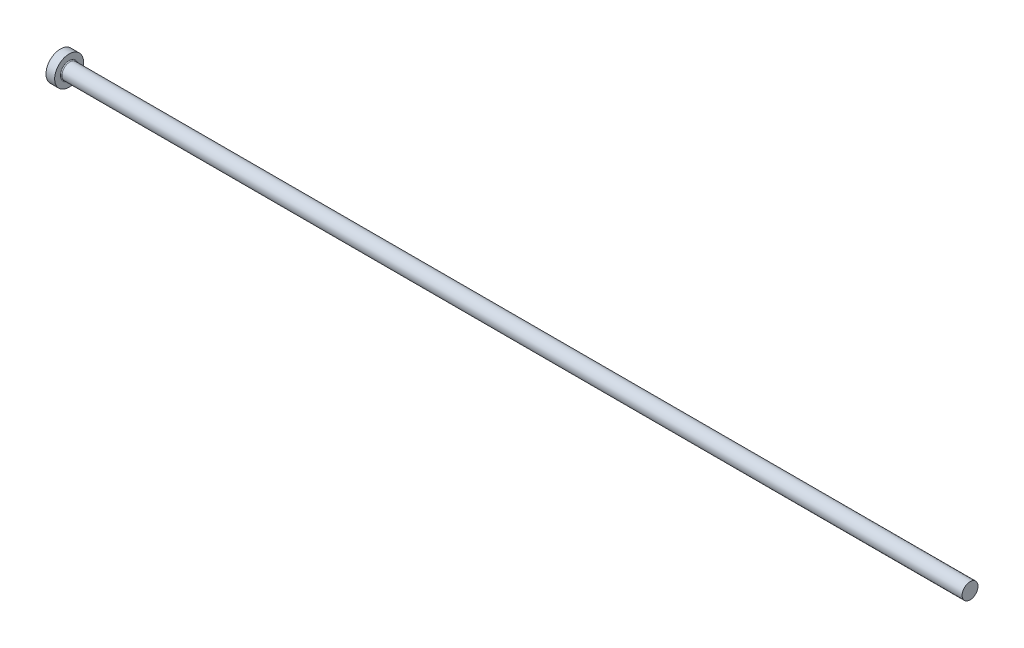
ISO-10303-21;
HEADER;
FILE_DESCRIPTION(('STEP AP214'),'2;1');
FILE_NAME('part.step','',(''),(''),'','','');
FILE_SCHEMA(('AUTOMOTIVE_DESIGN { 1 0 10303 214 1 1 1 1 }'));
ENDSEC;
DATA;
#1=APPLICATION_CONTEXT('core data for automotive mechanical design processes');
#2=APPLICATION_PROTOCOL_DEFINITION('international standard','automotive_design',2000,#1);
#3=PRODUCT_CONTEXT('',#1,'mechanical');
#4=PRODUCT('Part','Part','',(#3));
#5=PRODUCT_RELATED_PRODUCT_CATEGORY('part','',(#4));
#6=PRODUCT_DEFINITION_FORMATION('','',#4);
#7=PRODUCT_DEFINITION_CONTEXT('part definition',#1,'design');
#8=PRODUCT_DEFINITION('design','',#6,#7);
#9=PRODUCT_DEFINITION_SHAPE('','',#8);
#10=(LENGTH_UNIT() NAMED_UNIT(*) SI_UNIT(.MILLI.,.METRE.));
#11=(NAMED_UNIT(*) PLANE_ANGLE_UNIT() SI_UNIT($,.RADIAN.));
#12=(NAMED_UNIT(*) SI_UNIT($,.STERADIAN.) SOLID_ANGLE_UNIT());
#13=UNCERTAINTY_MEASURE_WITH_UNIT(LENGTH_MEASURE(1.E-05),#10,'distance_accuracy_value','');
#14=(GEOMETRIC_REPRESENTATION_CONTEXT(3) GLOBAL_UNCERTAINTY_ASSIGNED_CONTEXT((#13)) GLOBAL_UNIT_ASSIGNED_CONTEXT((#10,
#11,#12)) REPRESENTATION_CONTEXT('',''));
#15=CARTESIAN_POINT('',(0.,0.,0.));
#16=DIRECTION('',(0.,0.,1.));
#17=DIRECTION('',(1.,0.,0.));
#18=AXIS2_PLACEMENT_3D('',#15,#16,#17);
#19=CARTESIAN_POINT('',(0.,0.,0.));
#20=DIRECTION('',(-1.,0.,0.));
#21=DIRECTION('',(0.,-1.,0.));
#22=AXIS2_PLACEMENT_3D('',#19,#20,#21);
#23=PLANE('',#22);
#24=CARTESIAN_POINT('',(0.,0.,0.));
#25=DIRECTION('',(1.,0.,0.));
#26=DIRECTION('',(0.,1.,0.));
#27=AXIS2_PLACEMENT_3D('',#24,#25,#26);
#28=CIRCLE('',#27,5.);
#29=CARTESIAN_POINT('',(0.,5.,0.));
#30=VERTEX_POINT('',#29);
#31=EDGE_CURVE('E25',#30,#30,#28,.T.);
#32=ORIENTED_EDGE('',*,*,#31,.F.);
#33=EDGE_LOOP('',(#32));
#34=FACE_BOUND('',#33,.T.);
#35=ADVANCED_FACE('F14',(#34),#23,.T.);
#36=CARTESIAN_POINT('',(315.,0.,0.));
#37=DIRECTION('',(1.,0.,0.));
#38=DIRECTION('',(0.,1.,0.));
#39=AXIS2_PLACEMENT_3D('',#36,#37,#38);
#40=CYLINDRICAL_SURFACE('',#39,5.);
#41=ORIENTED_EDGE('',*,*,#31,.T.);
#42=EDGE_LOOP('',(#41));
#43=FACE_BOUND('',#42,.T.);
#44=CARTESIAN_POINT('',(3.,0.,0.));
#45=DIRECTION('',(1.,0.,0.));
#46=DIRECTION('',(0.,1.,0.));
#47=AXIS2_PLACEMENT_3D('',#44,#45,#46);
#48=CIRCLE('',#47,5.);
#49=CARTESIAN_POINT('',(3.,5.,0.));
#50=VERTEX_POINT('',#49);
#51=EDGE_CURVE('E29',#50,#50,#48,.T.);
#52=ORIENTED_EDGE('',*,*,#51,.F.);
#53=EDGE_LOOP('',(#52));
#54=FACE_BOUND('',#53,.T.);
#55=ADVANCED_FACE('F51',(#43,#54),#40,.T.);
#56=CARTESIAN_POINT('',(3.,5.,0.));
#57=DIRECTION('',(1.,0.,0.));
#58=DIRECTION('',(0.,1.,0.));
#59=AXIS2_PLACEMENT_3D('',#56,#57,#58);
#60=PLANE('',#59);
#61=CARTESIAN_POINT('',(3.,0.,0.));
#62=DIRECTION('',(1.,0.,0.));
#63=DIRECTION('',(0.,1.,0.));
#64=AXIS2_PLACEMENT_3D('',#61,#62,#63);
#65=CIRCLE('',#64,3.04999999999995);
#66=CARTESIAN_POINT('',(3.,3.04999999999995,0.));
#67=VERTEX_POINT('',#66);
#68=EDGE_CURVE('E9',#67,#67,#65,.F.);
#69=ORIENTED_EDGE('',*,*,#68,.T.);
#70=EDGE_LOOP('',(#69));
#71=FACE_BOUND('',#70,.T.);
#72=ORIENTED_EDGE('',*,*,#51,.T.);
#73=EDGE_LOOP('',(#72));
#74=FACE_BOUND('',#73,.T.);
#75=ADVANCED_FACE('F42',(#71,#74),#60,.T.);
#76=CARTESIAN_POINT('',(315.,0.,0.));
#77=DIRECTION('',(1.,0.,0.));
#78=DIRECTION('',(0.,1.,0.));
#79=AXIS2_PLACEMENT_3D('',#76,#77,#78);
#80=CYLINDRICAL_SURFACE('',#79,2.74999999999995);
#81=CARTESIAN_POINT('',(3.3,0.,0.));
#82=DIRECTION('',(1.,0.,0.));
#83=DIRECTION('',(0.,1.,0.));
#84=AXIS2_PLACEMENT_3D('',#81,#82,#83);
#85=CIRCLE('',#84,2.74999999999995);
#86=CARTESIAN_POINT('',(3.3,2.74999999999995,0.));
#87=VERTEX_POINT('',#86);
#88=EDGE_CURVE('E21',#87,#87,#85,.T.);
#89=ORIENTED_EDGE('',*,*,#88,.T.);
#90=EDGE_LOOP('',(#89));
#91=FACE_BOUND('',#90,.T.);
#92=CARTESIAN_POINT('',(315.,0.,0.));
#93=DIRECTION('',(1.,0.,0.));
#94=DIRECTION('',(0.,1.,0.));
#95=AXIS2_PLACEMENT_3D('',#92,#93,#94);
#96=CIRCLE('',#95,2.74999999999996);
#97=CARTESIAN_POINT('',(315.,2.74999999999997,0.));
#98=VERTEX_POINT('',#97);
#99=EDGE_CURVE('E34',#98,#98,#96,.T.);
#100=ORIENTED_EDGE('',*,*,#99,.F.);
#101=EDGE_LOOP('',(#100));
#102=FACE_BOUND('',#101,.T.);
#103=ADVANCED_FACE('F40',(#91,#102),#80,.T.);
#104=CARTESIAN_POINT('',(315.,2.75,0.));
#105=DIRECTION('',(1.,0.,0.));
#106=DIRECTION('',(0.,1.,0.));
#107=AXIS2_PLACEMENT_3D('',#104,#105,#106);
#108=PLANE('',#107);
#109=ORIENTED_EDGE('',*,*,#99,.T.);
#110=EDGE_LOOP('',(#109));
#111=FACE_BOUND('',#110,.T.);
#112=ADVANCED_FACE('F38',(#111),#108,.T.);
#113=CARTESIAN_POINT('',(3.3,0.,0.));
#114=DIRECTION('',(1.,0.,0.));
#115=DIRECTION('',(0.,1.,0.));
#116=AXIS2_PLACEMENT_3D('',#113,#114,#115);
#117=TOROIDAL_SURFACE('',#116,3.04999999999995,0.3);
#118=ORIENTED_EDGE('',*,*,#68,.F.);
#119=EDGE_LOOP('',(#118));
#120=FACE_BOUND('',#119,.T.);
#121=ORIENTED_EDGE('',*,*,#88,.F.);
#122=EDGE_LOOP('',(#121));
#123=FACE_BOUND('',#122,.T.);
#124=ADVANCED_FACE('F16',(#120,#123),#117,.F.);
#125=CLOSED_SHELL('',(#35,#55,#75,#103,#112,#124));
#126=MANIFOLD_SOLID_BREP('B1',#125);
#127=ADVANCED_BREP_SHAPE_REPRESENTATION('',(#18,#126),#14);
#128=SHAPE_DEFINITION_REPRESENTATION(#9,#127);
ENDSEC;
END-ISO-10303-21;
